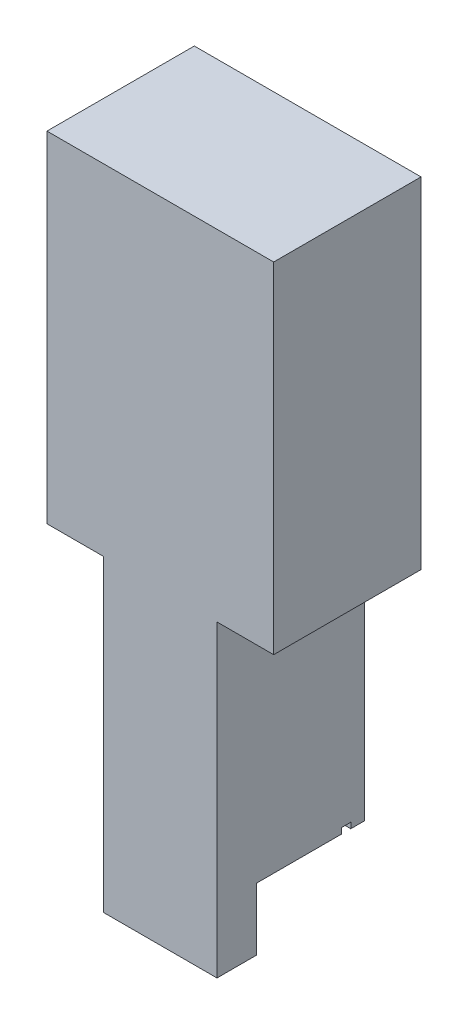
from build123d import *

# Parameters (mm, degrees)
EXTRUDE_1_DEPTH     = 13
SKETCH_2_OUTSIDE_W  = 27.394
SKETCH_2_OUTSIDE_H  = 71.594
CUT_EXTRUDE_1_DEPTH = 62.97451089


with BuildPart() as part:
    # Sketch 1 → Extrude 1 (new body)
    with BuildSketch(Plane.XY):
        Polygon((0, 27.2), (0, 57.2), (20, 57.2), (20, 27.2), (15, 27.2), (15, 0), (5, 0), (5, 27.2), align=None)
    extrude(amount=EXTRUDE_1_DEPTH)

    # Sketch 2 outside → Cut-Extrude 1 (cut, through all)
    with BuildSketch(Plane(origin=(20, 0, 0), x_dir=(0, 0, -1), z_dir=(1, 0, 0))):
        with Locations((-6.5, 28.6)):
            Rectangle(SKETCH_2_OUTSIDE_W, SKETCH_2_OUTSIDE_H)
        Polygon((-13, 0), (-9.5, 0), (-9.5, 5.5), (-2, 5.5), (-2, 6), (-1.2, 6), (-1.2, 5.5), (0, 5.5), (0, 57.2), (-13, 57.2), align=None, mode=Mode.SUBTRACT)
    extrude(amount=-CUT_EXTRUDE_1_DEPTH, mode=Mode.SUBTRACT)


solid = part.part
